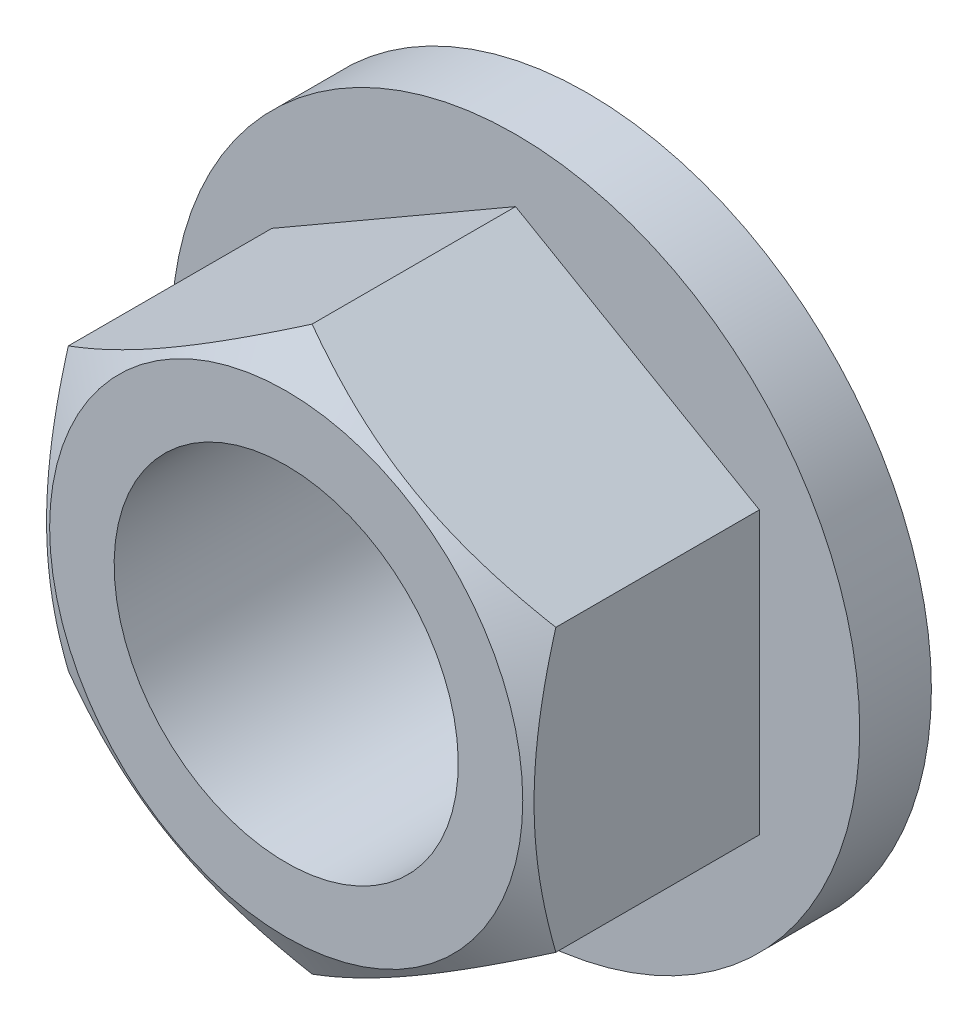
ISO-10303-21;
HEADER;
FILE_DESCRIPTION(('STEP AP214'),'2;1');
FILE_NAME('part.step','',(''),(''),'','','');
FILE_SCHEMA(('AUTOMOTIVE_DESIGN { 1 0 10303 214 1 1 1 1 }'));
ENDSEC;
DATA;
#1=APPLICATION_CONTEXT('core data for automotive mechanical design processes');
#2=APPLICATION_PROTOCOL_DEFINITION('international standard','automotive_design',2000,#1);
#3=PRODUCT_CONTEXT('',#1,'mechanical');
#4=PRODUCT('Part','Part','',(#3));
#5=PRODUCT_RELATED_PRODUCT_CATEGORY('part','',(#4));
#6=PRODUCT_DEFINITION_FORMATION('','',#4);
#7=PRODUCT_DEFINITION_CONTEXT('part definition',#1,'design');
#8=PRODUCT_DEFINITION('design','',#6,#7);
#9=PRODUCT_DEFINITION_SHAPE('','',#8);
#10=(LENGTH_UNIT() NAMED_UNIT(*) SI_UNIT(.MILLI.,.METRE.));
#11=(NAMED_UNIT(*) PLANE_ANGLE_UNIT() SI_UNIT($,.RADIAN.));
#12=(NAMED_UNIT(*) SI_UNIT($,.STERADIAN.) SOLID_ANGLE_UNIT());
#13=UNCERTAINTY_MEASURE_WITH_UNIT(LENGTH_MEASURE(1.E-05),#10,'distance_accuracy_value','');
#14=(GEOMETRIC_REPRESENTATION_CONTEXT(3) GLOBAL_UNCERTAINTY_ASSIGNED_CONTEXT((#13)) GLOBAL_UNIT_ASSIGNED_CONTEXT((#10,
#11,#12)) REPRESENTATION_CONTEXT('',''));
#15=CARTESIAN_POINT('',(0.,0.,0.));
#16=DIRECTION('',(0.,0.,1.));
#17=DIRECTION('',(1.,0.,0.));
#18=AXIS2_PLACEMENT_3D('',#15,#16,#17);
#19=CARTESIAN_POINT('',(8.5,4.90747728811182,10.5));
#20=DIRECTION('',(-0.5,-0.866025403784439,0.));
#21=DIRECTION('',(0.866025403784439,-0.5,0.));
#22=AXIS2_PLACEMENT_3D('',#19,#20,#21);
#23=PLANE('',#22);
#24=DIRECTION('',(0.,0.,-1.));
#25=VECTOR('',#24,1.);
#26=CARTESIAN_POINT('',(0.,9.81495457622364,10.5));
#27=LINE('',#26,#25);
#28=CARTESIAN_POINT('',(0.,9.81495457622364,9.59647305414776));
#29=VERTEX_POINT('',#28);
#30=CARTESIAN_POINT('',(0.,9.81495457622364,2.5));
#31=VERTEX_POINT('',#30);
#32=EDGE_CURVE('E9',#29,#31,#27,.T.);
#33=ORIENTED_EDGE('',*,*,#32,.F.);
#34=CARTESIAN_POINT('',(-0.00020000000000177,9.81507004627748,9.59640638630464));
#35=CARTESIAN_POINT('',(0.18663922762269,9.70719836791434,9.65867629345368));
#36=CARTESIAN_POINT('',(0.374175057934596,9.59892450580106,9.71812013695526));
#37=CARTESIAN_POINT('',(0.750769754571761,9.3814974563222,9.83057732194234));
#38=CARTESIAN_POINT('',(0.939829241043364,9.27234391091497,9.88358788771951));
#39=CARTESIAN_POINT('',(1.51003475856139,8.94313560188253,10.0319290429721));
#40=CARTESIAN_POINT('',(1.89343164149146,8.72178130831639,10.1163035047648));
#41=CARTESIAN_POINT('',(2.46717766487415,8.39052888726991,10.2152424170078));
#42=CARTESIAN_POINT('',(2.65581276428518,8.28162036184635,10.2434272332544));
#43=CARTESIAN_POINT('',(3.0339360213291,8.06331079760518,10.2906883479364));
#44=CARTESIAN_POINT('',(3.22342410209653,7.95390980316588,10.3097654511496));
#45=CARTESIAN_POINT('',(3.60272652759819,7.73491944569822,10.3383276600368));
#46=CARTESIAN_POINT('',(3.79254025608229,7.62533043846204,10.3478236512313));
#47=CARTESIAN_POINT('',(4.17234305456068,7.40605119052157,10.3570200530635));
#48=CARTESIAN_POINT('',(4.36233211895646,7.29636095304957,10.3567207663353));
#49=CARTESIAN_POINT('',(4.71752301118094,7.09129139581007,10.3470079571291));
#50=CARTESIAN_POINT('',(4.88274990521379,6.99589760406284,10.338779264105));
#51=CARTESIAN_POINT('',(5.21281671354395,6.80533344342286,10.3150731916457));
#52=CARTESIAN_POINT('',(5.37765660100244,6.71016309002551,10.2995953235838));
#53=CARTESIAN_POINT('',(5.87153810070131,6.42502047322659,10.242653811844));
#54=CARTESIAN_POINT('',(6.19970550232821,6.23555293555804,10.190689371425));
#55=CARTESIAN_POINT('',(6.85952142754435,5.8546080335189,10.0607774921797));
#56=CARTESIAN_POINT('',(7.19108574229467,5.66317928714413,9.98227936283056));
#57=CARTESIAN_POINT('',(7.84926989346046,5.28317649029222,9.80412109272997));
#58=CARTESIAN_POINT('',(8.17589815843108,5.09459757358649,9.70450279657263));
#59=CARTESIAN_POINT('',(8.5002,4.90736181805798,9.59640638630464));
#60=B_SPLINE_CURVE_WITH_KNOTS('',3,(#34,#35,#36,#37,#38,#39,#40,#41,#42,#43,#44,#45,#46,#47,#48,
#49,#50,#51,#52,#53,#54,#55,#56,#57,#58,#59),.UNSPECIFIED.,.F.,.F.,(4,2,2,2,2,2,2,2,2,2,2,2,4),
(0.,0.673596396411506,1.34748239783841,2.69805431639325,3.35679995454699,4.01548737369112,
4.67342558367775,5.33134346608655,5.90409556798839,6.47688628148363,7.62328361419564,
8.79510569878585,9.96462743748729),.UNSPECIFIED.);
#61=CARTESIAN_POINT('',(8.5,4.90747728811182,9.59647305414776));
#62=VERTEX_POINT('',#61);
#63=EDGE_CURVE('E67',#29,#62,#60,.T.);
#64=ORIENTED_EDGE('',*,*,#63,.T.);
#65=DIRECTION('',(0.,0.,-1.));
#66=VECTOR('',#65,1.);
#67=CARTESIAN_POINT('',(8.5,4.90747728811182,10.5));
#68=LINE('',#67,#66);
#69=CARTESIAN_POINT('',(8.5,4.90747728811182,2.5));
#70=VERTEX_POINT('',#69);
#71=EDGE_CURVE('E74',#62,#70,#68,.T.);
#72=ORIENTED_EDGE('',*,*,#71,.T.);
#73=DIRECTION('',(0.866025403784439,-0.5,0.));
#74=VECTOR('',#73,1.);
#75=CARTESIAN_POINT('',(8.5,4.90747728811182,2.5));
#76=LINE('',#75,#74);
#77=EDGE_CURVE('E109',#31,#70,#76,.T.);
#78=ORIENTED_EDGE('',*,*,#77,.F.);
#79=EDGE_LOOP('',(#33,#64,#72,#78));
#80=FACE_BOUND('',#79,.T.);
#81=ADVANCED_FACE('F14',(#80),#23,.F.);
#82=CARTESIAN_POINT('',(0.,9.81495457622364,10.5));
#83=DIRECTION('',(0.5,-0.866025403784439,0.));
#84=DIRECTION('',(0.866025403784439,0.5,0.));
#85=AXIS2_PLACEMENT_3D('',#82,#83,#84);
#86=PLANE('',#85);
#87=DIRECTION('',(0.,0.,-1.));
#88=VECTOR('',#87,1.);
#89=CARTESIAN_POINT('',(-8.5,4.90747728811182,10.5));
#90=LINE('',#89,#88);
#91=CARTESIAN_POINT('',(-8.5,4.90747728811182,9.59647305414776));
#92=VERTEX_POINT('',#91);
#93=CARTESIAN_POINT('',(-8.5,4.90747728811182,2.5));
#94=VERTEX_POINT('',#93);
#95=EDGE_CURVE('E22',#92,#94,#90,.T.);
#96=ORIENTED_EDGE('',*,*,#95,.F.);
#97=CARTESIAN_POINT('',(-8.5002,4.90736181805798,9.59640638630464));
#98=CARTESIAN_POINT('',(-8.31336077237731,5.01523349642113,9.65867629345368));
#99=CARTESIAN_POINT('',(-8.1258249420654,5.12350735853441,9.71812013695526));
#100=CARTESIAN_POINT('',(-7.74923024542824,5.34093440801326,9.83057732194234));
#101=CARTESIAN_POINT('',(-7.56017075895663,5.45008795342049,9.88358788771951));
#102=CARTESIAN_POINT('',(-6.9899652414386,5.77929626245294,10.0319290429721));
#103=CARTESIAN_POINT('',(-6.60656835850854,6.00065055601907,10.1163035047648));
#104=CARTESIAN_POINT('',(-6.03282233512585,6.33190297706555,10.2152424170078));
#105=CARTESIAN_POINT('',(-5.84418723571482,6.44081150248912,10.2434272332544));
#106=CARTESIAN_POINT('',(-5.46606397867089,6.65912106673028,10.2906883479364));
#107=CARTESIAN_POINT('',(-5.27657589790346,6.76852206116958,10.3097654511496));
#108=CARTESIAN_POINT('',(-4.8972734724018,6.98751241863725,10.3383276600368));
#109=CARTESIAN_POINT('',(-4.70745974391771,7.09710142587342,10.3478236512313));
#110=CARTESIAN_POINT('',(-4.32765694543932,7.3163806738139,10.3570200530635));
#111=CARTESIAN_POINT('',(-4.13766788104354,7.42607091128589,10.3567207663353));
#112=CARTESIAN_POINT('',(-3.78247698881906,7.63114046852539,10.3470079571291));
#113=CARTESIAN_POINT('',(-3.6172500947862,7.72653426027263,10.338779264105));
#114=CARTESIAN_POINT('',(-3.28718328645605,7.9170984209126,10.3150731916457));
#115=CARTESIAN_POINT('',(-3.12234339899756,8.01226877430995,10.2995953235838));
#116=CARTESIAN_POINT('',(-2.62846189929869,8.29741139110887,10.242653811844));
#117=CARTESIAN_POINT('',(-2.30029449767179,8.48687892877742,10.190689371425));
#118=CARTESIAN_POINT('',(-1.64047857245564,8.86782383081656,10.0607774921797));
#119=CARTESIAN_POINT('',(-1.30891425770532,9.05925257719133,9.98227936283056));
#120=CARTESIAN_POINT('',(-0.65073010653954,9.43925537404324,9.80412109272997));
#121=CARTESIAN_POINT('',(-0.324101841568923,9.62783429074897,9.70450279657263));
#122=CARTESIAN_POINT('',(0.0001999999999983,9.81507004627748,9.59640638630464));
#123=B_SPLINE_CURVE_WITH_KNOTS('',3,(#97,#98,#99,#100,#101,#102,#103,#104,#105,#106,#107,#108,
#109,#110,#111,#112,#113,#114,#115,#116,#117,#118,#119,#120,#121,#122),.UNSPECIFIED.,.F.,.F.,(4,
2,2,2,2,2,2,2,2,2,2,2,4),(0.,0.673596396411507,1.34748239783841,2.69805431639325,
3.35679995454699,4.01548737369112,4.67342558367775,5.33134346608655,5.90409556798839,
6.47688628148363,7.62328361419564,8.79510569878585,9.96462743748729),.UNSPECIFIED.);
#124=EDGE_CURVE('E77',#92,#29,#123,.T.);
#125=ORIENTED_EDGE('',*,*,#124,.T.);
#126=ORIENTED_EDGE('',*,*,#32,.T.);
#127=DIRECTION('',(0.866025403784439,0.5,0.));
#128=VECTOR('',#127,1.);
#129=CARTESIAN_POINT('',(0.,9.81495457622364,2.5));
#130=LINE('',#129,#128);
#131=EDGE_CURVE('E106',#94,#31,#130,.T.);
#132=ORIENTED_EDGE('',*,*,#131,.F.);
#133=EDGE_LOOP('',(#96,#125,#126,#132));
#134=FACE_BOUND('',#133,.T.);
#135=ADVANCED_FACE('F107',(#134),#86,.F.);
#136=CARTESIAN_POINT('',(-8.5,4.90747728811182,10.5));
#137=DIRECTION('',(1.,0.,0.));
#138=DIRECTION('',(0.,0.,-1.));
#139=AXIS2_PLACEMENT_3D('',#136,#137,#138);
#140=PLANE('',#139);
#141=DIRECTION('',(0.,0.,-1.));
#142=VECTOR('',#141,1.);
#143=CARTESIAN_POINT('',(-8.5,-4.90747728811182,10.5));
#144=LINE('',#143,#142);
#145=CARTESIAN_POINT('',(-8.5,-4.90747728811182,9.59647305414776));
#146=VERTEX_POINT('',#145);
#147=CARTESIAN_POINT('',(-8.5,-4.90747728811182,2.5));
#148=VERTEX_POINT('',#147);
#149=EDGE_CURVE('E94',#146,#148,#144,.T.);
#150=ORIENTED_EDGE('',*,*,#149,.F.);
#151=CARTESIAN_POINT('',(-8.5,-13.2077726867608,6.19496718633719));
#152=CARTESIAN_POINT('',(-8.5,-12.8363064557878,6.37526474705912));
#153=CARTESIAN_POINT('',(-8.5,-12.4639902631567,6.55384096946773));
#154=CARTESIAN_POINT('',(-8.5,-11.7172060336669,6.9065831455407));
#155=CARTESIAN_POINT('',(-8.5,-11.3427376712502,7.08074840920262));
#156=CARTESIAN_POINT('',(-8.5,-10.5892801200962,7.42457179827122));
#157=CARTESIAN_POINT('',(-8.5,-10.2102774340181,7.59420044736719));
#158=CARTESIAN_POINT('',(-8.5,-9.44926667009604,7.92655029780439));
#159=CARTESIAN_POINT('',(-8.5,-9.06725873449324,8.08927182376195));
#160=CARTESIAN_POINT('',(-8.5,-8.2871982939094,8.41111370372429));
#161=CARTESIAN_POINT('',(-8.5,-7.88902669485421,8.56994699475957));
#162=CARTESIAN_POINT('',(-8.5,-7.08803561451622,8.87565464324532));
#163=CARTESIAN_POINT('',(-8.5,-6.68521561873,9.02252766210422));
#164=CARTESIAN_POINT('',(-8.5,-5.87502769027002,9.30047747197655));
#165=CARTESIAN_POINT('',(-8.5,-5.46767076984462,9.43158601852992));
#166=CARTESIAN_POINT('',(-8.5,-4.64712808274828,9.67381844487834));
#167=CARTESIAN_POINT('',(-8.5,-4.23394418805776,9.78494859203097));
#168=CARTESIAN_POINT('',(-8.5,-3.40374429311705,9.98130797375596));
#169=CARTESIAN_POINT('',(-8.5,-2.98676268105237,10.0666786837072));
#170=CARTESIAN_POINT('',(-8.5,-2.35747255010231,10.1717327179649));
#171=CARTESIAN_POINT('',(-8.5,-2.14705762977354,10.2029184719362));
#172=CARTESIAN_POINT('',(-8.5,-1.72517319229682,10.2570115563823));
#173=CARTESIAN_POINT('',(-8.5,-1.5137037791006,10.2799196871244));
#174=CARTESIAN_POINT('',(-8.5,-1.09276766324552,10.3167124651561));
#175=CARTESIAN_POINT('',(-8.5,-0.883310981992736,10.3307113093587));
#176=CARTESIAN_POINT('',(-8.5,-0.463993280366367,10.3498376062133));
#177=CARTESIAN_POINT('',(-8.5,-0.254132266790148,10.354965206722));
#178=CARTESIAN_POINT('',(-8.5,0.165618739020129,10.3562266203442));
#179=CARTESIAN_POINT('',(-8.5,0.375508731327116,10.3523604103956));
#180=CARTESIAN_POINT('',(-8.5,0.794938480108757,10.3357290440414));
#181=CARTESIAN_POINT('',(-8.5,1.00447821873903,10.3229634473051));
#182=CARTESIAN_POINT('',(-8.5,1.50728563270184,10.2819245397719));
#183=CARTESIAN_POINT('',(-8.5,1.80021947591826,10.2494721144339));
#184=CARTESIAN_POINT('',(-8.5,2.38391612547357,10.1689392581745));
#185=CARTESIAN_POINT('',(-8.5,2.67467863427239,10.1208567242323));
#186=CARTESIAN_POINT('',(-8.5,3.543374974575,9.95571325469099));
#187=CARTESIAN_POINT('',(-8.5,4.11739473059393,9.81778629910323));
#188=CARTESIAN_POINT('',(-8.5,4.97574169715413,9.57856162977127));
#189=CARTESIAN_POINT('',(-8.5,5.26451977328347,9.49231486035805));
#190=CARTESIAN_POINT('',(-8.5,5.8392712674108,9.3108510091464));
#191=CARTESIAN_POINT('',(-8.5,6.12524466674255,9.21563386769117));
#192=CARTESIAN_POINT('',(-8.5,6.69447650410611,9.01775805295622));
#193=CARTESIAN_POINT('',(-8.5,6.97773579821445,8.91510181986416));
#194=CARTESIAN_POINT('',(-8.5,7.54190663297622,8.70355692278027));
#195=CARTESIAN_POINT('',(-8.5,7.82281820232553,8.59466833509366));
#196=CARTESIAN_POINT('',(-8.5,8.49047063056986,8.32870424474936));
#197=CARTESIAN_POINT('',(-8.5,8.87625678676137,8.16923644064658));
#198=CARTESIAN_POINT('',(-8.5,9.64450738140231,7.84246750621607));
#199=CARTESIAN_POINT('',(-8.5,10.0269716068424,7.67516587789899));
#200=CARTESIAN_POINT('',(-8.5,10.7892048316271,7.33431404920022));
#201=CARTESIAN_POINT('',(-8.5,11.1689731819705,7.16076240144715));
#202=CARTESIAN_POINT('',(-8.5,11.9261806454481,6.80868430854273));
#203=CARTESIAN_POINT('',(-8.5,12.3036198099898,6.63015797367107));
#204=CARTESIAN_POINT('',(-8.5,13.0569841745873,6.2688676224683));
#205=CARTESIAN_POINT('',(-8.5,13.4329071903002,6.08609905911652));
#206=CARTESIAN_POINT('',(-8.5,14.1831213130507,5.71724408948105));
#207=CARTESIAN_POINT('',(-8.5,14.5574124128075,5.5311576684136));
#208=CARTESIAN_POINT('',(-8.5,15.6781316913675,4.96886152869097));
#209=CARTESIAN_POINT('',(-8.5,16.4225091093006,4.58856499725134));
#210=CARTESIAN_POINT('',(-8.5,17.8440956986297,3.85303417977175));
#211=CARTESIAN_POINT('',(-8.5,18.5216283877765,3.49842234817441));
#212=CARTESIAN_POINT('',(-8.5,19.8741812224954,2.78438240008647));
#213=CARTESIAN_POINT('',(-8.5,20.5492012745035,2.42495410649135));
#214=CARTESIAN_POINT('',(-8.5,21.8955600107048,1.7033597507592));
#215=CARTESIAN_POINT('',(-8.5,22.5669036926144,1.34120299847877));
#216=CARTESIAN_POINT('',(-8.5,23.9079875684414,0.614021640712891));
#217=CARTESIAN_POINT('',(-8.5,24.5777278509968,0.248997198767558));
#218=CARTESIAN_POINT('',(-8.5,25.2468795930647,-0.117095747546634));
#219=B_SPLINE_CURVE_WITH_KNOTS('',3,(#151,#152,#153,#154,#155,#156,#157,#158,#159,#160,#161,
#162,#163,#164,#165,#166,#167,#168,#169,#170,#171,#172,#173,#174,#175,#176,#177,#178,#179,#180,
#181,#182,#183,#184,#185,#186,#187,#188,#189,#190,#191,#192,#193,#194,#195,#196,#197,#198,#199,
#200,#201,#202,#203,#204,#205,#206,#207,#208,#209,#210,#211,#212,#213,#214,#215,#216,#217,#218),
.UNSPECIFIED.,.F.,.F.,(4,2,2,2,2,2,2,2,2,2,2,2,2,2,2,2,2,2,2,2,2,2,2,2,2,2,2,2,2,2,2,2,2,4),(0.,
1.23874391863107,2.47768043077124,3.72331866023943,4.96889828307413,6.25479649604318,
7.54083842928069,8.82424478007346,10.1072478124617,11.3830704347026,12.0210734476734,
12.6590147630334,13.2886050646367,13.9181848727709,14.5477662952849,15.1773788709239,
16.0610579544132,16.9448559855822,18.7134204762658,19.6174915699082,20.5215686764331,
21.4253505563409,22.3291213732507,23.5813411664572,24.8336406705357,26.086232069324,
27.3387957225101,28.5927703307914,29.8467505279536,32.3543668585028,34.6485129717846,
36.9427436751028,39.2311284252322,41.5193836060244),.UNSPECIFIED.);
#220=EDGE_CURVE('E104',#146,#92,#219,.T.);
#221=ORIENTED_EDGE('',*,*,#220,.T.);
#222=ORIENTED_EDGE('',*,*,#95,.T.);
#223=DIRECTION('',(0.,1.,0.));
#224=VECTOR('',#223,1.);
#225=CARTESIAN_POINT('',(-8.5,4.90747728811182,2.5));
#226=LINE('',#225,#224);
#227=EDGE_CURVE('E102',#148,#94,#226,.T.);
#228=ORIENTED_EDGE('',*,*,#227,.F.);
#229=EDGE_LOOP('',(#150,#221,#222,#228));
#230=FACE_BOUND('',#229,.T.);
#231=ADVANCED_FACE('F100',(#230),#140,.F.);
#232=CARTESIAN_POINT('',(-8.5,-4.90747728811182,10.5));
#233=DIRECTION('',(0.5,0.866025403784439,0.));
#234=DIRECTION('',(-0.866025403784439,0.5,0.));
#235=AXIS2_PLACEMENT_3D('',#232,#233,#234);
#236=PLANE('',#235);
#237=DIRECTION('',(0.,0.,-1.));
#238=VECTOR('',#237,1.);
#239=CARTESIAN_POINT('',(0.,-9.81495457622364,10.5));
#240=LINE('',#239,#238);
#241=CARTESIAN_POINT('',(0.,-9.81495457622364,9.59647305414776));
#242=VERTEX_POINT('',#241);
#243=CARTESIAN_POINT('',(0.,-9.81495457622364,2.5));
#244=VERTEX_POINT('',#243);
#245=EDGE_CURVE('E86',#242,#244,#240,.T.);
#246=ORIENTED_EDGE('',*,*,#245,.F.);
#247=CARTESIAN_POINT('',(0.000200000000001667,-9.81507004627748,9.59640638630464));
#248=CARTESIAN_POINT('',(-0.186639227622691,-9.70719836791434,9.65867629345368));
#249=CARTESIAN_POINT('',(-0.374175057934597,-9.59892450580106,9.71812013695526));
#250=CARTESIAN_POINT('',(-0.750769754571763,-9.3814974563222,9.83057732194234));
#251=CARTESIAN_POINT('',(-0.939829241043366,-9.27234391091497,9.88358788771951));
#252=CARTESIAN_POINT('',(-1.51003475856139,-8.94313560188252,10.0319290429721));
#253=CARTESIAN_POINT('',(-1.89343164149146,-8.72178130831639,10.1163035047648));
#254=CARTESIAN_POINT('',(-2.46717766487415,-8.39052888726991,10.2152424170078));
#255=CARTESIAN_POINT('',(-2.65581276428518,-8.28162036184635,10.2434272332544));
#256=CARTESIAN_POINT('',(-3.0339360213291,-8.06331079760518,10.2906883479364));
#257=CARTESIAN_POINT('',(-3.22342410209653,-7.95390980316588,10.3097654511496));
#258=CARTESIAN_POINT('',(-3.60272652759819,-7.73491944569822,10.3383276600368));
#259=CARTESIAN_POINT('',(-3.79254025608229,-7.62533043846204,10.3478236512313));
#260=CARTESIAN_POINT('',(-4.17234305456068,-7.40605119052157,10.3570200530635));
#261=CARTESIAN_POINT('',(-4.36233211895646,-7.29636095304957,10.3567207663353));
#262=CARTESIAN_POINT('',(-4.71752301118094,-7.09129139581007,10.3470079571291));
#263=CARTESIAN_POINT('',(-4.88274990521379,-6.99589760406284,10.338779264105));
#264=CARTESIAN_POINT('',(-5.21281671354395,-6.80533344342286,10.3150731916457));
#265=CARTESIAN_POINT('',(-5.37765660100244,-6.71016309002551,10.2995953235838));
#266=CARTESIAN_POINT('',(-5.87153810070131,-6.42502047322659,10.242653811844));
#267=CARTESIAN_POINT('',(-6.19970550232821,-6.23555293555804,10.190689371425));
#268=CARTESIAN_POINT('',(-6.85952142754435,-5.8546080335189,10.0607774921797));
#269=CARTESIAN_POINT('',(-7.19108574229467,-5.66317928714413,9.98227936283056));
#270=CARTESIAN_POINT('',(-7.84926989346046,-5.28317649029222,9.80412109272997));
#271=CARTESIAN_POINT('',(-8.17589815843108,-5.09459757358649,9.70450279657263));
#272=CARTESIAN_POINT('',(-8.5002,-4.90736181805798,9.59640638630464));
#273=B_SPLINE_CURVE_WITH_KNOTS('',3,(#247,#248,#249,#250,#251,#252,#253,#254,#255,#256,#257,
#258,#259,#260,#261,#262,#263,#264,#265,#266,#267,#268,#269,#270,#271,#272),.UNSPECIFIED.,.F.,
.F.,(4,2,2,2,2,2,2,2,2,2,2,2,4),(0.,0.673596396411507,1.34748239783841,2.69805431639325,
3.35679995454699,4.01548737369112,4.67342558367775,5.33134346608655,5.90409556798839,
6.47688628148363,7.62328361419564,8.79510569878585,9.9646274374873),.UNSPECIFIED.);
#274=EDGE_CURVE('E199',#242,#146,#273,.T.);
#275=ORIENTED_EDGE('',*,*,#274,.T.);
#276=ORIENTED_EDGE('',*,*,#149,.T.);
#277=DIRECTION('',(-0.866025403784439,0.5,0.));
#278=VECTOR('',#277,1.);
#279=CARTESIAN_POINT('',(-8.5,-4.90747728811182,2.5));
#280=LINE('',#279,#278);
#281=EDGE_CURVE('E114',#244,#148,#280,.T.);
#282=ORIENTED_EDGE('',*,*,#281,.F.);
#283=EDGE_LOOP('',(#246,#275,#276,#282));
#284=FACE_BOUND('',#283,.T.);
#285=ADVANCED_FACE('F155',(#284),#236,.F.);
#286=CARTESIAN_POINT('',(0.,-9.81495457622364,10.5));
#287=DIRECTION('',(-0.5,0.866025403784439,0.));
#288=DIRECTION('',(-0.866025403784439,-0.5,0.));
#289=AXIS2_PLACEMENT_3D('',#286,#287,#288);
#290=PLANE('',#289);
#291=DIRECTION('',(0.,0.,-1.));
#292=VECTOR('',#291,1.);
#293=CARTESIAN_POINT('',(8.5,-4.90747728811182,10.5));
#294=LINE('',#293,#292);
#295=CARTESIAN_POINT('',(8.5,-4.90747728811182,9.59647305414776));
#296=VERTEX_POINT('',#295);
#297=CARTESIAN_POINT('',(8.5,-4.90747728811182,2.5));
#298=VERTEX_POINT('',#297);
#299=EDGE_CURVE('E83',#296,#298,#294,.T.);
#300=ORIENTED_EDGE('',*,*,#299,.F.);
#301=CARTESIAN_POINT('',(8.5002,-4.90736181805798,9.59640638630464));
#302=CARTESIAN_POINT('',(8.31336077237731,-5.01523349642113,9.65867629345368));
#303=CARTESIAN_POINT('',(8.1258249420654,-5.12350735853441,9.71812013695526));
#304=CARTESIAN_POINT('',(7.74923024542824,-5.34093440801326,9.83057732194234));
#305=CARTESIAN_POINT('',(7.56017075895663,-5.45008795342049,9.88358788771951));
#306=CARTESIAN_POINT('',(6.9899652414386,-5.77929626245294,10.0319290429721));
#307=CARTESIAN_POINT('',(6.60656835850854,-6.00065055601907,10.1163035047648));
#308=CARTESIAN_POINT('',(6.03282233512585,-6.33190297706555,10.2152424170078));
#309=CARTESIAN_POINT('',(5.84418723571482,-6.44081150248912,10.2434272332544));
#310=CARTESIAN_POINT('',(5.46606397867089,-6.65912106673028,10.2906883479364));
#311=CARTESIAN_POINT('',(5.27657589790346,-6.76852206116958,10.3097654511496));
#312=CARTESIAN_POINT('',(4.8972734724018,-6.98751241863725,10.3383276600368));
#313=CARTESIAN_POINT('',(4.70745974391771,-7.09710142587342,10.3478236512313));
#314=CARTESIAN_POINT('',(4.32765694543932,-7.3163806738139,10.3570200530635));
#315=CARTESIAN_POINT('',(4.13766788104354,-7.42607091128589,10.3567207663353));
#316=CARTESIAN_POINT('',(3.78247698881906,-7.63114046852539,10.3470079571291));
#317=CARTESIAN_POINT('',(3.6172500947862,-7.72653426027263,10.338779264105));
#318=CARTESIAN_POINT('',(3.28718328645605,-7.9170984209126,10.3150731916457));
#319=CARTESIAN_POINT('',(3.12234339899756,-8.01226877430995,10.2995953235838));
#320=CARTESIAN_POINT('',(2.62846189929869,-8.29741139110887,10.242653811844));
#321=CARTESIAN_POINT('',(2.30029449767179,-8.48687892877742,10.190689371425));
#322=CARTESIAN_POINT('',(1.64047857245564,-8.86782383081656,10.0607774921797));
#323=CARTESIAN_POINT('',(1.30891425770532,-9.05925257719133,9.98227936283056));
#324=CARTESIAN_POINT('',(0.65073010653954,-9.43925537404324,9.80412109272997));
#325=CARTESIAN_POINT('',(0.324101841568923,-9.62783429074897,9.70450279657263));
#326=CARTESIAN_POINT('',(-0.000199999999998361,-9.81507004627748,9.59640638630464));
#327=B_SPLINE_CURVE_WITH_KNOTS('',3,(#301,#302,#303,#304,#305,#306,#307,#308,#309,#310,#311,
#312,#313,#314,#315,#316,#317,#318,#319,#320,#321,#322,#323,#324,#325,#326),.UNSPECIFIED.,.F.,
.F.,(4,2,2,2,2,2,2,2,2,2,2,2,4),(0.,0.673596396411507,1.34748239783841,2.69805431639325,
3.35679995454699,4.01548737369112,4.67342558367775,5.33134346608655,5.90409556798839,
6.47688628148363,7.62328361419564,8.79510569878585,9.96462743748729),.UNSPECIFIED.);
#328=EDGE_CURVE('E29',#296,#242,#327,.T.);
#329=ORIENTED_EDGE('',*,*,#328,.T.);
#330=ORIENTED_EDGE('',*,*,#245,.T.);
#331=DIRECTION('',(-0.866025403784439,-0.5,0.));
#332=VECTOR('',#331,1.);
#333=CARTESIAN_POINT('',(0.,-9.81495457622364,2.5));
#334=LINE('',#333,#332);
#335=EDGE_CURVE('E116',#298,#244,#334,.T.);
#336=ORIENTED_EDGE('',*,*,#335,.F.);
#337=EDGE_LOOP('',(#300,#329,#330,#336));
#338=FACE_BOUND('',#337,.T.);
#339=ADVANCED_FACE('F143',(#338),#290,.F.);
#340=CARTESIAN_POINT('',(8.5,-4.90747728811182,10.5));
#341=DIRECTION('',(-1.,0.,0.));
#342=DIRECTION('',(0.,0.,1.));
#343=AXIS2_PLACEMENT_3D('',#340,#341,#342);
#344=PLANE('',#343);
#345=ORIENTED_EDGE('',*,*,#71,.F.);
#346=CARTESIAN_POINT('',(8.5,-13.2077726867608,6.19496718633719));
#347=CARTESIAN_POINT('',(8.5,-12.8363064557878,6.37526474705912));
#348=CARTESIAN_POINT('',(8.5,-12.4639902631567,6.55384096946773));
#349=CARTESIAN_POINT('',(8.5,-11.7172060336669,6.9065831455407));
#350=CARTESIAN_POINT('',(8.5,-11.3427376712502,7.08074840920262));
#351=CARTESIAN_POINT('',(8.5,-10.5892801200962,7.42457179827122));
#352=CARTESIAN_POINT('',(8.5,-10.2102774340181,7.59420044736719));
#353=CARTESIAN_POINT('',(8.5,-9.44926667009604,7.92655029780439));
#354=CARTESIAN_POINT('',(8.5,-9.06725873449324,8.08927182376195));
#355=CARTESIAN_POINT('',(8.5,-8.2871982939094,8.41111370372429));
#356=CARTESIAN_POINT('',(8.5,-7.88902669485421,8.56994699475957));
#357=CARTESIAN_POINT('',(8.5,-7.08803561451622,8.87565464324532));
#358=CARTESIAN_POINT('',(8.5,-6.68521561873,9.02252766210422));
#359=CARTESIAN_POINT('',(8.5,-5.87502769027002,9.30047747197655));
#360=CARTESIAN_POINT('',(8.5,-5.46767076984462,9.43158601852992));
#361=CARTESIAN_POINT('',(8.5,-4.64712808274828,9.67381844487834));
#362=CARTESIAN_POINT('',(8.5,-4.23394418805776,9.78494859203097));
#363=CARTESIAN_POINT('',(8.5,-3.40374429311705,9.98130797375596));
#364=CARTESIAN_POINT('',(8.5,-2.98676268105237,10.0666786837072));
#365=CARTESIAN_POINT('',(8.5,-2.35747255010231,10.1717327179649));
#366=CARTESIAN_POINT('',(8.5,-2.14705762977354,10.2029184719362));
#367=CARTESIAN_POINT('',(8.5,-1.72517319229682,10.2570115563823));
#368=CARTESIAN_POINT('',(8.5,-1.5137037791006,10.2799196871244));
#369=CARTESIAN_POINT('',(8.5,-1.09276766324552,10.3167124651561));
#370=CARTESIAN_POINT('',(8.5,-0.883310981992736,10.3307113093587));
#371=CARTESIAN_POINT('',(8.5,-0.463993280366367,10.3498376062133));
#372=CARTESIAN_POINT('',(8.5,-0.254132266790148,10.354965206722));
#373=CARTESIAN_POINT('',(8.5,0.165618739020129,10.3562266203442));
#374=CARTESIAN_POINT('',(8.5,0.375508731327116,10.3523604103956));
#375=CARTESIAN_POINT('',(8.5,0.794938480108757,10.3357290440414));
#376=CARTESIAN_POINT('',(8.5,1.00447821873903,10.3229634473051));
#377=CARTESIAN_POINT('',(8.5,1.50728563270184,10.2819245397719));
#378=CARTESIAN_POINT('',(8.5,1.80021947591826,10.2494721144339));
#379=CARTESIAN_POINT('',(8.5,2.38391612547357,10.1689392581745));
#380=CARTESIAN_POINT('',(8.5,2.67467863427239,10.1208567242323));
#381=CARTESIAN_POINT('',(8.5,3.543374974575,9.95571325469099));
#382=CARTESIAN_POINT('',(8.5,4.11739473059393,9.81778629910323));
#383=CARTESIAN_POINT('',(8.5,4.97574169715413,9.57856162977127));
#384=CARTESIAN_POINT('',(8.5,5.26451977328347,9.49231486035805));
#385=CARTESIAN_POINT('',(8.5,5.8392712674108,9.3108510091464));
#386=CARTESIAN_POINT('',(8.5,6.12524466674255,9.21563386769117));
#387=CARTESIAN_POINT('',(8.5,6.69447650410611,9.01775805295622));
#388=CARTESIAN_POINT('',(8.5,6.97773579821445,8.91510181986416));
#389=CARTESIAN_POINT('',(8.5,7.54190663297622,8.70355692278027));
#390=CARTESIAN_POINT('',(8.5,7.82281820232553,8.59466833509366));
#391=CARTESIAN_POINT('',(8.5,8.49047063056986,8.32870424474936));
#392=CARTESIAN_POINT('',(8.5,8.87625678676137,8.16923644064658));
#393=CARTESIAN_POINT('',(8.5,9.64450738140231,7.84246750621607));
#394=CARTESIAN_POINT('',(8.5,10.0269716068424,7.67516587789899));
#395=CARTESIAN_POINT('',(8.5,10.7892048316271,7.33431404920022));
#396=CARTESIAN_POINT('',(8.5,11.1689731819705,7.16076240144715));
#397=CARTESIAN_POINT('',(8.5,11.9261806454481,6.80868430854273));
#398=CARTESIAN_POINT('',(8.5,12.3036198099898,6.63015797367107));
#399=CARTESIAN_POINT('',(8.5,13.0569841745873,6.2688676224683));
#400=CARTESIAN_POINT('',(8.5,13.4329071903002,6.08609905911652));
#401=CARTESIAN_POINT('',(8.5,14.1831213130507,5.71724408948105));
#402=CARTESIAN_POINT('',(8.5,14.5574124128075,5.5311576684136));
#403=CARTESIAN_POINT('',(8.5,15.6781316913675,4.96886152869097));
#404=CARTESIAN_POINT('',(8.5,16.4225091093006,4.58856499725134));
#405=CARTESIAN_POINT('',(8.5,17.8440956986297,3.85303417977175));
#406=CARTESIAN_POINT('',(8.5,18.5216283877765,3.49842234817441));
#407=CARTESIAN_POINT('',(8.5,19.8741812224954,2.78438240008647));
#408=CARTESIAN_POINT('',(8.5,20.5492012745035,2.42495410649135));
#409=CARTESIAN_POINT('',(8.5,21.8955600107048,1.7033597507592));
#410=CARTESIAN_POINT('',(8.5,22.5669036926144,1.34120299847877));
#411=CARTESIAN_POINT('',(8.5,23.9079875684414,0.614021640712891));
#412=CARTESIAN_POINT('',(8.5,24.5777278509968,0.248997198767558));
#413=CARTESIAN_POINT('',(8.5,25.2468795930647,-0.117095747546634));
#414=B_SPLINE_CURVE_WITH_KNOTS('',3,(#346,#347,#348,#349,#350,#351,#352,#353,#354,#355,#356,
#357,#358,#359,#360,#361,#362,#363,#364,#365,#366,#367,#368,#369,#370,#371,#372,#373,#374,#375,
#376,#377,#378,#379,#380,#381,#382,#383,#384,#385,#386,#387,#388,#389,#390,#391,#392,#393,#394,
#395,#396,#397,#398,#399,#400,#401,#402,#403,#404,#405,#406,#407,#408,#409,#410,#411,#412,#413),
.UNSPECIFIED.,.F.,.F.,(4,2,2,2,2,2,2,2,2,2,2,2,2,2,2,2,2,2,2,2,2,2,2,2,2,2,2,2,2,2,2,2,2,4),(0.,
1.23874391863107,2.47768043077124,3.72331866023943,4.96889828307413,6.25479649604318,
7.54083842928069,8.82424478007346,10.1072478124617,11.3830704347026,12.0210734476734,
12.6590147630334,13.2886050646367,13.9181848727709,14.5477662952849,15.1773788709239,
16.0610579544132,16.9448559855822,18.7134204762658,19.6174915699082,20.5215686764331,
21.4253505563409,22.3291213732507,23.5813411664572,24.8336406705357,26.086232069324,
27.3387957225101,28.5927703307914,29.8467505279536,32.3543668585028,34.6485129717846,
36.9427436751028,39.2311284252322,41.5193836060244),.UNSPECIFIED.);
#415=EDGE_CURVE('E64',#62,#296,#414,.F.);
#416=ORIENTED_EDGE('',*,*,#415,.T.);
#417=ORIENTED_EDGE('',*,*,#299,.T.);
#418=DIRECTION('',(0.,-1.,0.));
#419=VECTOR('',#418,1.);
#420=CARTESIAN_POINT('',(8.5,-4.90747728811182,2.5));
#421=LINE('',#420,#419);
#422=EDGE_CURVE('E81',#70,#298,#421,.T.);
#423=ORIENTED_EDGE('',*,*,#422,.F.);
#424=EDGE_LOOP('',(#345,#416,#417,#423));
#425=FACE_BOUND('',#424,.T.);
#426=ADVANCED_FACE('F79',(#425),#344,.F.);
#427=CARTESIAN_POINT('',(0.,9.81495457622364,10.5));
#428=DIRECTION('',(0.,0.,1.));
#429=DIRECTION('',(0.,1.,0.));
#430=AXIS2_PLACEMENT_3D('',#427,#428,#429);
#431=PLANE('',#430);
#432=CARTESIAN_POINT('',(0.,0.,10.5));
#433=DIRECTION('',(0.,0.,-1.));
#434=DIRECTION('',(0.,-1.,0.));
#435=AXIS2_PLACEMENT_3D('',#432,#433,#434);
#436=CIRCLE('',#435,8.25);
#437=CARTESIAN_POINT('',(0.,-8.25,10.5));
#438=VERTEX_POINT('',#437);
#439=EDGE_CURVE('E71',#438,#438,#436,.T.);
#440=ORIENTED_EDGE('',*,*,#439,.F.);
#441=EDGE_LOOP('',(#440));
#442=FACE_BOUND('',#441,.T.);
#443=CARTESIAN_POINT('',(0.,0.,10.5));
#444=DIRECTION('',(0.,0.,1.));
#445=DIRECTION('',(0.,1.,0.));
#446=AXIS2_PLACEMENT_3D('',#443,#444,#445);
#447=CIRCLE('',#446,6.);
#448=CARTESIAN_POINT('',(0.,6.,10.5));
#449=VERTEX_POINT('',#448);
#450=EDGE_CURVE('E84',#449,#449,#447,.T.);
#451=ORIENTED_EDGE('',*,*,#450,.F.);
#452=EDGE_LOOP('',(#451));
#453=FACE_BOUND('',#452,.T.);
#454=ADVANCED_FACE('F132',(#442,#453),#431,.T.);
#455=CARTESIAN_POINT('',(0.,9.81495457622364,0.));
#456=DIRECTION('',(0.,0.,1.));
#457=DIRECTION('',(0.,1.,0.));
#458=AXIS2_PLACEMENT_3D('',#455,#456,#457);
#459=PLANE('',#458);
#460=CARTESIAN_POINT('',(0.,0.,0.));
#461=DIRECTION('',(0.,0.,1.));
#462=DIRECTION('',(0.,1.,0.));
#463=AXIS2_PLACEMENT_3D('',#460,#461,#462);
#464=CIRCLE('',#463,6.);
#465=CARTESIAN_POINT('',(0.,6.,0.));
#466=VERTEX_POINT('',#465);
#467=EDGE_CURVE('E89',#466,#466,#464,.T.);
#468=ORIENTED_EDGE('',*,*,#467,.T.);
#469=EDGE_LOOP('',(#468));
#470=FACE_BOUND('',#469,.T.);
#471=CARTESIAN_POINT('',(0.,0.,0.));
#472=DIRECTION('',(0.,0.,-1.));
#473=DIRECTION('',(0.,-1.,0.));
#474=AXIS2_PLACEMENT_3D('',#471,#472,#473);
#475=CIRCLE('',#474,12.);
#476=CARTESIAN_POINT('',(0.,-12.,0.));
#477=VERTEX_POINT('',#476);
#478=EDGE_CURVE('E76',#477,#477,#475,.T.);
#479=ORIENTED_EDGE('',*,*,#478,.T.);
#480=EDGE_LOOP('',(#479));
#481=FACE_BOUND('',#480,.T.);
#482=ADVANCED_FACE('F123',(#470,#481),#459,.F.);
#483=CARTESIAN_POINT('',(0.,0.,10.5));
#484=DIRECTION('',(0.,0.,-1.));
#485=DIRECTION('',(0.,-1.,0.));
#486=AXIS2_PLACEMENT_3D('',#483,#484,#485);
#487=CYLINDRICAL_SURFACE('',#486,6.);
#488=ORIENTED_EDGE('',*,*,#467,.F.);
#489=EDGE_LOOP('',(#488));
#490=FACE_BOUND('',#489,.T.);
#491=ORIENTED_EDGE('',*,*,#450,.T.);
#492=EDGE_LOOP('',(#491));
#493=FACE_BOUND('',#492,.T.);
#494=ADVANCED_FACE('F126',(#490,#493),#487,.F.);
#495=CARTESIAN_POINT('',(0.,0.,2.5));
#496=DIRECTION('',(0.,0.,-1.));
#497=DIRECTION('',(0.,-1.,0.));
#498=AXIS2_PLACEMENT_3D('',#495,#496,#497);
#499=PLANE('',#498);
#500=CARTESIAN_POINT('',(0.,0.,2.5));
#501=DIRECTION('',(0.,0.,-1.));
#502=DIRECTION('',(0.,-1.,0.));
#503=AXIS2_PLACEMENT_3D('',#500,#501,#502);
#504=CIRCLE('',#503,12.);
#505=CARTESIAN_POINT('',(0.,-12.,2.5));
#506=VERTEX_POINT('',#505);
#507=EDGE_CURVE('E217',#506,#506,#504,.T.);
#508=ORIENTED_EDGE('',*,*,#507,.F.);
#509=EDGE_LOOP('',(#508));
#510=FACE_BOUND('',#509,.T.);
#511=ORIENTED_EDGE('',*,*,#131,.T.);
#512=ORIENTED_EDGE('',*,*,#77,.T.);
#513=ORIENTED_EDGE('',*,*,#422,.T.);
#514=ORIENTED_EDGE('',*,*,#335,.T.);
#515=ORIENTED_EDGE('',*,*,#281,.T.);
#516=ORIENTED_EDGE('',*,*,#227,.T.);
#517=EDGE_LOOP('',(#511,#512,#513,#514,#515,#516));
#518=FACE_BOUND('',#517,.T.);
#519=ADVANCED_FACE('F111',(#510,#518),#499,.F.);
#520=CARTESIAN_POINT('',(0.,0.,2.5));
#521=DIRECTION('',(0.,0.,-1.));
#522=DIRECTION('',(0.,-1.,0.));
#523=AXIS2_PLACEMENT_3D('',#520,#521,#522);
#524=CYLINDRICAL_SURFACE('',#523,12.);
#525=ORIENTED_EDGE('',*,*,#507,.T.);
#526=EDGE_LOOP('',(#525));
#527=FACE_BOUND('',#526,.T.);
#528=ORIENTED_EDGE('',*,*,#478,.F.);
#529=EDGE_LOOP('',(#528));
#530=FACE_BOUND('',#529,.T.);
#531=ADVANCED_FACE('F180',(#527,#530),#524,.T.);
#532=CARTESIAN_POINT('',(0.,0.,10.5));
#533=DIRECTION('',(0.,0.,-1.));
#534=DIRECTION('',(0.,-1.,0.));
#535=AXIS2_PLACEMENT_3D('',#532,#533,#534);
#536=CONICAL_SURFACE('',#535,8.25,1.0471975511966);
#537=ORIENTED_EDGE('',*,*,#439,.T.);
#538=EDGE_LOOP('',(#537));
#539=FACE_BOUND('',#538,.T.);
#540=ORIENTED_EDGE('',*,*,#124,.F.);
#541=ORIENTED_EDGE('',*,*,#220,.F.);
#542=ORIENTED_EDGE('',*,*,#274,.F.);
#543=ORIENTED_EDGE('',*,*,#328,.F.);
#544=ORIENTED_EDGE('',*,*,#415,.F.);
#545=ORIENTED_EDGE('',*,*,#63,.F.);
#546=EDGE_LOOP('',(#540,#541,#542,#543,#544,#545));
#547=FACE_BOUND('',#546,.T.);
#548=ADVANCED_FACE('F66',(#539,#547),#536,.T.);
#549=CLOSED_SHELL('',(#81,#135,#231,#285,#339,#426,#454,#482,#494,#519,#531,#548));
#550=MANIFOLD_SOLID_BREP('B1',#549);
#551=ADVANCED_BREP_SHAPE_REPRESENTATION('',(#18,#550),#14);
#552=SHAPE_DEFINITION_REPRESENTATION(#9,#551);
ENDSEC;
END-ISO-10303-21;
